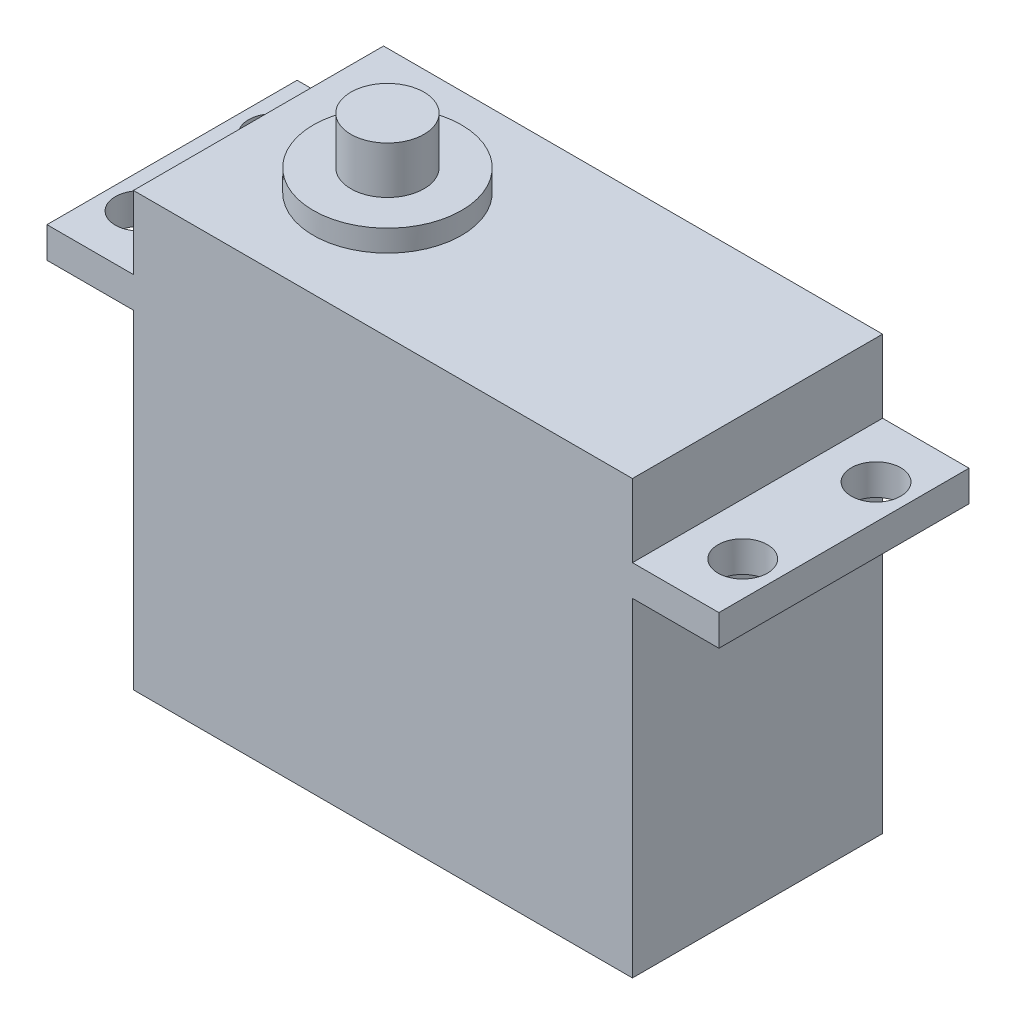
ISO-10303-21;
HEADER;
FILE_DESCRIPTION(('STEP AP214'),'2;1');
FILE_NAME('part.step','',(''),(''),'','','');
FILE_SCHEMA(('AUTOMOTIVE_DESIGN { 1 0 10303 214 1 1 1 1 }'));
ENDSEC;
DATA;
#1=APPLICATION_CONTEXT('core data for automotive mechanical design processes');
#2=APPLICATION_PROTOCOL_DEFINITION('international standard','automotive_design',2000,#1);
#3=PRODUCT_CONTEXT('',#1,'mechanical');
#4=PRODUCT('Part','Part','',(#3));
#5=PRODUCT_RELATED_PRODUCT_CATEGORY('part','',(#4));
#6=PRODUCT_DEFINITION_FORMATION('','',#4);
#7=PRODUCT_DEFINITION_CONTEXT('part definition',#1,'design');
#8=PRODUCT_DEFINITION('design','',#6,#7);
#9=PRODUCT_DEFINITION_SHAPE('','',#8);
#10=(LENGTH_UNIT() NAMED_UNIT(*) SI_UNIT(.MILLI.,.METRE.));
#11=(NAMED_UNIT(*) PLANE_ANGLE_UNIT() SI_UNIT($,.RADIAN.));
#12=(NAMED_UNIT(*) SI_UNIT($,.STERADIAN.) SOLID_ANGLE_UNIT());
#13=UNCERTAINTY_MEASURE_WITH_UNIT(LENGTH_MEASURE(1.E-05),#10,'distance_accuracy_value','');
#14=(GEOMETRIC_REPRESENTATION_CONTEXT(3) GLOBAL_UNCERTAINTY_ASSIGNED_CONTEXT((#13)) GLOBAL_UNIT_ASSIGNED_CONTEXT((#10,
#11,#12)) REPRESENTATION_CONTEXT('',''));
#15=CARTESIAN_POINT('',(0.,0.,0.));
#16=DIRECTION('',(0.,0.,1.));
#17=DIRECTION('',(1.,0.,0.));
#18=AXIS2_PLACEMENT_3D('',#15,#16,#17);
#19=CARTESIAN_POINT('',(0.,35.02,0.));
#20=DIRECTION('',(0.,-1.,0.));
#21=DIRECTION('',(0.,0.,-1.));
#22=AXIS2_PLACEMENT_3D('',#19,#20,#21);
#23=PLANE('',#22);
#24=DIRECTION('',(1.,0.,0.));
#25=VECTOR('',#24,1.);
#26=CARTESIAN_POINT('',(40.4,35.02,0.));
#27=LINE('',#26,#25);
#28=CARTESIAN_POINT('',(0.,35.02,0.));
#29=VERTEX_POINT('',#28);
#30=CARTESIAN_POINT('',(40.4,35.02,0.));
#31=VERTEX_POINT('',#30);
#32=EDGE_CURVE('E189',#29,#31,#27,.T.);
#33=ORIENTED_EDGE('',*,*,#32,.T.);
#34=DIRECTION('',(0.,0.,-1.));
#35=VECTOR('',#34,1.);
#36=CARTESIAN_POINT('',(40.4,35.02,-20.25));
#37=LINE('',#36,#35);
#38=CARTESIAN_POINT('',(40.4,35.02,-20.25));
#39=VERTEX_POINT('',#38);
#40=EDGE_CURVE('E192',#31,#39,#37,.T.);
#41=ORIENTED_EDGE('',*,*,#40,.T.);
#42=DIRECTION('',(-1.,0.,0.));
#43=VECTOR('',#42,1.);
#44=CARTESIAN_POINT('',(0.,35.02,-20.25));
#45=LINE('',#44,#43);
#46=CARTESIAN_POINT('',(0.,35.02,-20.25));
#47=VERTEX_POINT('',#46);
#48=EDGE_CURVE('E195',#39,#47,#45,.T.);
#49=ORIENTED_EDGE('',*,*,#48,.T.);
#50=DIRECTION('',(0.,0.,1.));
#51=VECTOR('',#50,1.);
#52=CARTESIAN_POINT('',(0.,35.02,0.));
#53=LINE('',#52,#51);
#54=EDGE_CURVE('E197',#47,#29,#53,.T.);
#55=ORIENTED_EDGE('',*,*,#54,.T.);
#56=EDGE_LOOP('',(#33,#41,#49,#55));
#57=FACE_BOUND('',#56,.T.);
#58=CARTESIAN_POINT('',(10.44,35.02,-10.125));
#59=DIRECTION('',(0.,-1.,0.));
#60=DIRECTION('',(0.,0.,-1.));
#61=AXIS2_PLACEMENT_3D('',#58,#59,#60);
#62=CIRCLE('',#61,6.);
#63=CARTESIAN_POINT('',(10.44,35.02,-16.125));
#64=VERTEX_POINT('',#63);
#65=EDGE_CURVE('E11',#64,#64,#62,.F.);
#66=ORIENTED_EDGE('',*,*,#65,.F.);
#67=EDGE_LOOP('',(#66));
#68=FACE_BOUND('',#67,.T.);
#69=ADVANCED_FACE('F34',(#57,#68),#23,.F.);
#70=CARTESIAN_POINT('',(0.,26.62,-20.25));
#71=DIRECTION('',(1.,0.,0.));
#72=DIRECTION('',(0.,0.,-1.));
#73=AXIS2_PLACEMENT_3D('',#70,#71,#72);
#74=PLANE('',#73);
#75=DIRECTION('',(0.,0.,1.));
#76=VECTOR('',#75,1.);
#77=CARTESIAN_POINT('',(0.,0.,-20.25));
#78=LINE('',#77,#76);
#79=CARTESIAN_POINT('',(0.,0.,-20.25));
#80=VERTEX_POINT('',#79);
#81=CARTESIAN_POINT('',(0.,0.,0.));
#82=VERTEX_POINT('',#81);
#83=EDGE_CURVE('E337',#80,#82,#78,.T.);
#84=ORIENTED_EDGE('',*,*,#83,.T.);
#85=DIRECTION('',(0.,-1.,0.));
#86=VECTOR('',#85,1.);
#87=CARTESIAN_POINT('',(0.,26.62,0.));
#88=LINE('',#87,#86);
#89=CARTESIAN_POINT('',(0.,26.62,0.));
#90=VERTEX_POINT('',#89);
#91=EDGE_CURVE('E42',#90,#82,#88,.T.);
#92=ORIENTED_EDGE('',*,*,#91,.F.);
#93=DIRECTION('',(0.,0.,1.));
#94=VECTOR('',#93,1.);
#95=CARTESIAN_POINT('',(0.,26.62,-20.25));
#96=LINE('',#95,#94);
#97=CARTESIAN_POINT('',(0.,26.62,-20.25));
#98=VERTEX_POINT('',#97);
#99=EDGE_CURVE('E364',#98,#90,#96,.T.);
#100=ORIENTED_EDGE('',*,*,#99,.F.);
#101=DIRECTION('',(0.,-1.,0.));
#102=VECTOR('',#101,1.);
#103=CARTESIAN_POINT('',(0.,26.62,-20.25));
#104=LINE('',#103,#102);
#105=EDGE_CURVE('E363',#98,#80,#104,.T.);
#106=ORIENTED_EDGE('',*,*,#105,.T.);
#107=EDGE_LOOP('',(#84,#92,#100,#106));
#108=FACE_BOUND('',#107,.T.);
#109=DIRECTION('',(0.,0.,1.));
#110=VECTOR('',#109,1.);
#111=CARTESIAN_POINT('',(0.,3.35,-10.125));
#112=LINE('',#111,#110);
#113=CARTESIAN_POINT('',(0.,3.35,-13.37));
#114=VERTEX_POINT('',#113);
#115=CARTESIAN_POINT('',(0.,3.35,-6.88));
#116=VERTEX_POINT('',#115);
#117=EDGE_CURVE('E160',#114,#116,#112,.T.);
#118=ORIENTED_EDGE('',*,*,#117,.F.);
#119=DIRECTION('',(0.,-1.,0.));
#120=VECTOR('',#119,1.);
#121=CARTESIAN_POINT('',(0.,6.96,-13.37));
#122=LINE('',#121,#120);
#123=CARTESIAN_POINT('',(0.,6.96,-13.37));
#124=VERTEX_POINT('',#123);
#125=EDGE_CURVE('E155',#124,#114,#122,.T.);
#126=ORIENTED_EDGE('',*,*,#125,.F.);
#127=DIRECTION('',(0.,0.,-1.));
#128=VECTOR('',#127,1.);
#129=CARTESIAN_POINT('',(0.,6.96,-6.88));
#130=LINE('',#129,#128);
#131=CARTESIAN_POINT('',(0.,6.96,-6.88));
#132=VERTEX_POINT('',#131);
#133=EDGE_CURVE('E54',#132,#124,#130,.T.);
#134=ORIENTED_EDGE('',*,*,#133,.F.);
#135=DIRECTION('',(0.,1.,0.));
#136=VECTOR('',#135,1.);
#137=CARTESIAN_POINT('',(0.,3.35,-6.88));
#138=LINE('',#137,#136);
#139=EDGE_CURVE('E49',#116,#132,#138,.T.);
#140=ORIENTED_EDGE('',*,*,#139,.F.);
#141=EDGE_LOOP('',(#118,#126,#134,#140));
#142=FACE_BOUND('',#141,.T.);
#143=ADVANCED_FACE('F36',(#108,#142),#74,.F.);
#144=CARTESIAN_POINT('',(47.4,29.12,0.));
#145=DIRECTION('',(0.,1.,0.));
#146=DIRECTION('',(0.,0.,1.));
#147=AXIS2_PLACEMENT_3D('',#144,#145,#146);
#148=PLANE('',#147);
#149=CARTESIAN_POINT('',(-4.2,29.12,-15.52));
#150=DIRECTION('',(0.,1.,0.));
#151=DIRECTION('',(0.,0.,-1.));
#152=AXIS2_PLACEMENT_3D('',#149,#150,#151);
#153=CIRCLE('',#152,2.);
#154=CARTESIAN_POINT('',(-4.2,29.12,-17.52));
#155=VERTEX_POINT('',#154);
#156=EDGE_CURVE('E238',#155,#155,#153,.T.);
#157=ORIENTED_EDGE('',*,*,#156,.F.);
#158=EDGE_LOOP('',(#157));
#159=FACE_BOUND('',#158,.T.);
#160=CARTESIAN_POINT('',(-4.2,29.12,-4.73));
#161=DIRECTION('',(0.,1.,0.));
#162=DIRECTION('',(0.,0.,1.));
#163=AXIS2_PLACEMENT_3D('',#160,#161,#162);
#164=CIRCLE('',#163,2.);
#165=CARTESIAN_POINT('',(-4.2,29.12,-2.73));
#166=VERTEX_POINT('',#165);
#167=EDGE_CURVE('E235',#166,#166,#164,.T.);
#168=ORIENTED_EDGE('',*,*,#167,.F.);
#169=EDGE_LOOP('',(#168));
#170=FACE_BOUND('',#169,.T.);
#171=DIRECTION('',(0.,0.,1.));
#172=VECTOR('',#171,1.);
#173=CARTESIAN_POINT('',(0.,29.12,0.));
#174=LINE('',#173,#172);
#175=CARTESIAN_POINT('',(0.,29.12,-20.25));
#176=VERTEX_POINT('',#175);
#177=CARTESIAN_POINT('',(0.,29.12,0.));
#178=VERTEX_POINT('',#177);
#179=EDGE_CURVE('E193',#176,#178,#174,.T.);
#180=ORIENTED_EDGE('',*,*,#179,.F.);
#181=DIRECTION('',(-1.,0.,0.));
#182=VECTOR('',#181,1.);
#183=CARTESIAN_POINT('',(47.4,29.12,-20.25));
#184=LINE('',#183,#182);
#185=CARTESIAN_POINT('',(-7.,29.12,-20.25));
#186=VERTEX_POINT('',#185);
#187=EDGE_CURVE('E208',#176,#186,#184,.T.);
#188=ORIENTED_EDGE('',*,*,#187,.T.);
#189=DIRECTION('',(0.,0.,1.));
#190=VECTOR('',#189,1.);
#191=CARTESIAN_POINT('',(-7.,29.12,-20.25));
#192=LINE('',#191,#190);
#193=CARTESIAN_POINT('',(-7.,29.12,0.));
#194=VERTEX_POINT('',#193);
#195=EDGE_CURVE('E321',#186,#194,#192,.T.);
#196=ORIENTED_EDGE('',*,*,#195,.T.);
#197=DIRECTION('',(1.,0.,0.));
#198=VECTOR('',#197,1.);
#199=CARTESIAN_POINT('',(-7.,29.12,0.));
#200=LINE('',#199,#198);
#201=EDGE_CURVE('E278',#194,#178,#200,.T.);
#202=ORIENTED_EDGE('',*,*,#201,.T.);
#203=EDGE_LOOP('',(#180,#188,#196,#202));
#204=FACE_BOUND('',#203,.T.);
#205=ADVANCED_FACE('F268',(#159,#170,#204),#148,.T.);
#206=CARTESIAN_POINT('',(0.,26.62,0.));
#207=DIRECTION('',(0.,0.,-1.));
#208=DIRECTION('',(-1.,0.,0.));
#209=AXIS2_PLACEMENT_3D('',#206,#207,#208);
#210=PLANE('',#209);
#211=DIRECTION('',(1.,0.,0.));
#212=VECTOR('',#211,1.);
#213=CARTESIAN_POINT('',(0.,0.,0.));
#214=LINE('',#213,#212);
#215=CARTESIAN_POINT('',(40.4,0.,0.));
#216=VERTEX_POINT('',#215);
#217=EDGE_CURVE('E384',#82,#216,#214,.T.);
#218=ORIENTED_EDGE('',*,*,#217,.T.);
#219=DIRECTION('',(0.,-1.,0.));
#220=VECTOR('',#219,1.);
#221=CARTESIAN_POINT('',(40.4,26.62,0.));
#222=LINE('',#221,#220);
#223=CARTESIAN_POINT('',(40.4,26.62,0.));
#224=VERTEX_POINT('',#223);
#225=EDGE_CURVE('E377',#224,#216,#222,.T.);
#226=ORIENTED_EDGE('',*,*,#225,.F.);
#227=DIRECTION('',(1.,0.,0.));
#228=VECTOR('',#227,1.);
#229=CARTESIAN_POINT('',(20.2,26.62,0.));
#230=LINE('',#229,#228);
#231=CARTESIAN_POINT('',(47.4,26.62,0.));
#232=VERTEX_POINT('',#231);
#233=EDGE_CURVE('E220',#224,#232,#230,.T.);
#234=ORIENTED_EDGE('',*,*,#233,.T.);
#235=DIRECTION('',(0.,-1.,0.));
#236=VECTOR('',#235,1.);
#237=CARTESIAN_POINT('',(47.4,29.12,0.));
#238=LINE('',#237,#236);
#239=CARTESIAN_POINT('',(47.4,29.12,0.));
#240=VERTEX_POINT('',#239);
#241=EDGE_CURVE('E307',#240,#232,#238,.T.);
#242=ORIENTED_EDGE('',*,*,#241,.F.);
#243=CARTESIAN_POINT('',(40.4,29.12,0.));
#244=VERTEX_POINT('',#243);
#245=EDGE_CURVE('E303',#244,#240,#200,.T.);
#246=ORIENTED_EDGE('',*,*,#245,.F.);
#247=DIRECTION('',(0.,-1.,0.));
#248=VECTOR('',#247,1.);
#249=CARTESIAN_POINT('',(40.4,35.02,0.));
#250=LINE('',#249,#248);
#251=EDGE_CURVE('E214',#31,#244,#250,.T.);
#252=ORIENTED_EDGE('',*,*,#251,.F.);
#253=ORIENTED_EDGE('',*,*,#32,.F.);
#254=DIRECTION('',(0.,-1.,0.));
#255=VECTOR('',#254,1.);
#256=CARTESIAN_POINT('',(0.,35.02,0.));
#257=LINE('',#256,#255);
#258=EDGE_CURVE('E199',#29,#178,#257,.T.);
#259=ORIENTED_EDGE('',*,*,#258,.T.);
#260=ORIENTED_EDGE('',*,*,#201,.F.);
#261=DIRECTION('',(0.,-1.,0.));
#262=VECTOR('',#261,1.);
#263=CARTESIAN_POINT('',(-7.,29.12,0.));
#264=LINE('',#263,#262);
#265=CARTESIAN_POINT('',(-7.,26.62,0.));
#266=VERTEX_POINT('',#265);
#267=EDGE_CURVE('E324',#194,#266,#264,.T.);
#268=ORIENTED_EDGE('',*,*,#267,.T.);
#269=EDGE_CURVE('E333',#266,#90,#230,.T.);
#270=ORIENTED_EDGE('',*,*,#269,.T.);
#271=ORIENTED_EDGE('',*,*,#91,.T.);
#272=EDGE_LOOP('',(#218,#226,#234,#242,#246,#252,#253,#259,#260,#268,#270,#271));
#273=FACE_BOUND('',#272,.T.);
#274=ADVANCED_FACE('F271',(#273),#210,.F.);
#275=CARTESIAN_POINT('',(40.4,26.62,0.));
#276=DIRECTION('',(-1.,0.,0.));
#277=DIRECTION('',(0.,0.,1.));
#278=AXIS2_PLACEMENT_3D('',#275,#276,#277);
#279=PLANE('',#278);
#280=DIRECTION('',(0.,0.,-1.));
#281=VECTOR('',#280,1.);
#282=CARTESIAN_POINT('',(40.4,0.,0.));
#283=LINE('',#282,#281);
#284=CARTESIAN_POINT('',(40.4,0.,-20.25));
#285=VERTEX_POINT('',#284);
#286=EDGE_CURVE('E386',#216,#285,#283,.T.);
#287=ORIENTED_EDGE('',*,*,#286,.T.);
#288=DIRECTION('',(0.,-1.,0.));
#289=VECTOR('',#288,1.);
#290=CARTESIAN_POINT('',(40.4,26.62,-20.25));
#291=LINE('',#290,#289);
#292=CARTESIAN_POINT('',(40.4,26.62,-20.25));
#293=VERTEX_POINT('',#292);
#294=EDGE_CURVE('E367',#293,#285,#291,.T.);
#295=ORIENTED_EDGE('',*,*,#294,.F.);
#296=DIRECTION('',(0.,0.,-1.));
#297=VECTOR('',#296,1.);
#298=CARTESIAN_POINT('',(40.4,26.62,0.));
#299=LINE('',#298,#297);
#300=EDGE_CURVE('E360',#224,#293,#299,.T.);
#301=ORIENTED_EDGE('',*,*,#300,.F.);
#302=ORIENTED_EDGE('',*,*,#225,.T.);
#303=EDGE_LOOP('',(#287,#295,#301,#302));
#304=FACE_BOUND('',#303,.T.);
#305=ADVANCED_FACE('F401',(#304),#279,.F.);
#306=CARTESIAN_POINT('',(40.4,26.62,-20.25));
#307=DIRECTION('',(0.,0.,1.));
#308=DIRECTION('',(1.,0.,0.));
#309=AXIS2_PLACEMENT_3D('',#306,#307,#308);
#310=PLANE('',#309);
#311=DIRECTION('',(-1.,0.,0.));
#312=VECTOR('',#311,1.);
#313=CARTESIAN_POINT('',(40.4,0.,-20.25));
#314=LINE('',#313,#312);
#315=EDGE_CURVE('E370',#285,#80,#314,.T.);
#316=ORIENTED_EDGE('',*,*,#315,.T.);
#317=ORIENTED_EDGE('',*,*,#105,.F.);
#318=DIRECTION('',(-1.,0.,0.));
#319=VECTOR('',#318,1.);
#320=CARTESIAN_POINT('',(47.4,26.62,-20.25));
#321=LINE('',#320,#319);
#322=CARTESIAN_POINT('',(-7.,26.62,-20.25));
#323=VERTEX_POINT('',#322);
#324=EDGE_CURVE('E345',#98,#323,#321,.T.);
#325=ORIENTED_EDGE('',*,*,#324,.T.);
#326=DIRECTION('',(0.,-1.,0.));
#327=VECTOR('',#326,1.);
#328=CARTESIAN_POINT('',(-7.,29.12,-20.25));
#329=LINE('',#328,#327);
#330=EDGE_CURVE('E287',#186,#323,#329,.T.);
#331=ORIENTED_EDGE('',*,*,#330,.F.);
#332=ORIENTED_EDGE('',*,*,#187,.F.);
#333=DIRECTION('',(0.,-1.,0.));
#334=VECTOR('',#333,1.);
#335=CARTESIAN_POINT('',(0.,35.02,-20.25));
#336=LINE('',#335,#334);
#337=EDGE_CURVE('E215',#47,#176,#336,.T.);
#338=ORIENTED_EDGE('',*,*,#337,.F.);
#339=ORIENTED_EDGE('',*,*,#48,.F.);
#340=DIRECTION('',(0.,-1.,0.));
#341=VECTOR('',#340,1.);
#342=CARTESIAN_POINT('',(40.4,35.02,-20.25));
#343=LINE('',#342,#341);
#344=CARTESIAN_POINT('',(40.4,29.12,-20.25));
#345=VERTEX_POINT('',#344);
#346=EDGE_CURVE('E211',#39,#345,#343,.T.);
#347=ORIENTED_EDGE('',*,*,#346,.T.);
#348=CARTESIAN_POINT('',(47.4,29.12,-20.25));
#349=VERTEX_POINT('',#348);
#350=EDGE_CURVE('E289',#349,#345,#184,.T.);
#351=ORIENTED_EDGE('',*,*,#350,.F.);
#352=DIRECTION('',(0.,-1.,0.));
#353=VECTOR('',#352,1.);
#354=CARTESIAN_POINT('',(47.4,29.12,-20.25));
#355=LINE('',#354,#353);
#356=CARTESIAN_POINT('',(47.4,26.62,-20.25));
#357=VERTEX_POINT('',#356);
#358=EDGE_CURVE('E338',#349,#357,#355,.T.);
#359=ORIENTED_EDGE('',*,*,#358,.T.);
#360=EDGE_CURVE('E313',#357,#293,#321,.T.);
#361=ORIENTED_EDGE('',*,*,#360,.T.);
#362=ORIENTED_EDGE('',*,*,#294,.T.);
#363=EDGE_LOOP('',(#316,#317,#325,#331,#332,#338,#339,#347,#351,#359,#361,#362));
#364=FACE_BOUND('',#363,.T.);
#365=ADVANCED_FACE('F283',(#364),#310,.F.);
#366=CARTESIAN_POINT('',(0.,0.,0.));
#367=DIRECTION('',(0.,1.,0.));
#368=DIRECTION('',(0.,0.,1.));
#369=AXIS2_PLACEMENT_3D('',#366,#367,#368);
#370=PLANE('',#369);
#371=ORIENTED_EDGE('',*,*,#83,.F.);
#372=ORIENTED_EDGE('',*,*,#315,.F.);
#373=ORIENTED_EDGE('',*,*,#286,.F.);
#374=ORIENTED_EDGE('',*,*,#217,.F.);
#375=EDGE_LOOP('',(#371,#372,#373,#374));
#376=FACE_BOUND('',#375,.T.);
#377=ADVANCED_FACE('F400',(#376),#370,.F.);
#378=CARTESIAN_POINT('',(47.4,26.62,0.));
#379=DIRECTION('',(0.,1.,0.));
#380=DIRECTION('',(0.,0.,1.));
#381=AXIS2_PLACEMENT_3D('',#378,#379,#380);
#382=PLANE('',#381);
#383=CARTESIAN_POINT('',(-4.2,26.62,-15.52));
#384=DIRECTION('',(0.,1.,0.));
#385=DIRECTION('',(0.,0.,1.));
#386=AXIS2_PLACEMENT_3D('',#383,#384,#385);
#387=CIRCLE('',#386,2.);
#388=CARTESIAN_POINT('',(-4.2,26.62,-13.52));
#389=VERTEX_POINT('',#388);
#390=EDGE_CURVE('E236',#389,#389,#387,.T.);
#391=ORIENTED_EDGE('',*,*,#390,.T.);
#392=EDGE_LOOP('',(#391));
#393=FACE_BOUND('',#392,.T.);
#394=CARTESIAN_POINT('',(-4.2,26.62,-4.73));
#395=DIRECTION('',(0.,1.,0.));
#396=DIRECTION('',(0.,0.,1.));
#397=AXIS2_PLACEMENT_3D('',#394,#395,#396);
#398=CIRCLE('',#397,2.);
#399=CARTESIAN_POINT('',(-4.2,26.62,-2.73));
#400=VERTEX_POINT('',#399);
#401=EDGE_CURVE('E176',#400,#400,#398,.T.);
#402=ORIENTED_EDGE('',*,*,#401,.T.);
#403=EDGE_LOOP('',(#402));
#404=FACE_BOUND('',#403,.T.);
#405=ORIENTED_EDGE('',*,*,#324,.F.);
#406=ORIENTED_EDGE('',*,*,#99,.T.);
#407=ORIENTED_EDGE('',*,*,#269,.F.);
#408=DIRECTION('',(0.,0.,1.));
#409=VECTOR('',#408,1.);
#410=CARTESIAN_POINT('',(-7.,26.62,-20.25));
#411=LINE('',#410,#409);
#412=EDGE_CURVE('E309',#323,#266,#411,.T.);
#413=ORIENTED_EDGE('',*,*,#412,.F.);
#414=EDGE_LOOP('',(#405,#406,#407,#413));
#415=FACE_BOUND('',#414,.T.);
#416=ADVANCED_FACE('F425',(#393,#404,#415),#382,.F.);
#417=CARTESIAN_POINT('',(44.6,26.62,-4.73));
#418=DIRECTION('',(0.,1.,0.));
#419=DIRECTION('',(0.,0.,1.));
#420=AXIS2_PLACEMENT_3D('',#417,#418,#419);
#421=CIRCLE('',#420,2.);
#422=CARTESIAN_POINT('',(44.6,26.62,-2.73000000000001));
#423=VERTEX_POINT('',#422);
#424=EDGE_CURVE('E246',#423,#423,#421,.T.);
#425=ORIENTED_EDGE('',*,*,#424,.T.);
#426=EDGE_LOOP('',(#425));
#427=FACE_BOUND('',#426,.T.);
#428=CARTESIAN_POINT('',(44.6,26.62,-15.52));
#429=DIRECTION('',(0.,1.,0.));
#430=DIRECTION('',(0.,0.,1.));
#431=AXIS2_PLACEMENT_3D('',#428,#429,#430);
#432=CIRCLE('',#431,2.);
#433=CARTESIAN_POINT('',(44.6,26.62,-13.52));
#434=VERTEX_POINT('',#433);
#435=EDGE_CURVE('E258',#434,#434,#432,.T.);
#436=ORIENTED_EDGE('',*,*,#435,.T.);
#437=EDGE_LOOP('',(#436));
#438=FACE_BOUND('',#437,.T.);
#439=ORIENTED_EDGE('',*,*,#233,.F.);
#440=ORIENTED_EDGE('',*,*,#300,.T.);
#441=ORIENTED_EDGE('',*,*,#360,.F.);
#442=DIRECTION('',(0.,0.,-1.));
#443=VECTOR('',#442,1.);
#444=CARTESIAN_POINT('',(47.4,26.62,0.));
#445=LINE('',#444,#443);
#446=EDGE_CURVE('E327',#232,#357,#445,.T.);
#447=ORIENTED_EDGE('',*,*,#446,.F.);
#448=EDGE_LOOP('',(#439,#440,#441,#447));
#449=FACE_BOUND('',#448,.T.);
#450=ADVANCED_FACE('F358',(#427,#438,#449),#382,.F.);
#451=CARTESIAN_POINT('',(47.4,29.12,0.));
#452=DIRECTION('',(-1.,0.,0.));
#453=DIRECTION('',(0.,0.,1.));
#454=AXIS2_PLACEMENT_3D('',#451,#452,#453);
#455=PLANE('',#454);
#456=ORIENTED_EDGE('',*,*,#446,.T.);
#457=ORIENTED_EDGE('',*,*,#358,.F.);
#458=DIRECTION('',(0.,0.,-1.));
#459=VECTOR('',#458,1.);
#460=CARTESIAN_POINT('',(47.4,29.12,0.));
#461=LINE('',#460,#459);
#462=EDGE_CURVE('E290',#240,#349,#461,.T.);
#463=ORIENTED_EDGE('',*,*,#462,.F.);
#464=ORIENTED_EDGE('',*,*,#241,.T.);
#465=EDGE_LOOP('',(#456,#457,#463,#464));
#466=FACE_BOUND('',#465,.T.);
#467=ADVANCED_FACE('F354',(#466),#455,.F.);
#468=CARTESIAN_POINT('',(-7.,29.12,-20.25));
#469=DIRECTION('',(1.,0.,0.));
#470=DIRECTION('',(0.,0.,-1.));
#471=AXIS2_PLACEMENT_3D('',#468,#469,#470);
#472=PLANE('',#471);
#473=ORIENTED_EDGE('',*,*,#412,.T.);
#474=ORIENTED_EDGE('',*,*,#267,.F.);
#475=ORIENTED_EDGE('',*,*,#195,.F.);
#476=ORIENTED_EDGE('',*,*,#330,.T.);
#477=EDGE_LOOP('',(#473,#474,#475,#476));
#478=FACE_BOUND('',#477,.T.);
#479=ADVANCED_FACE('F423',(#478),#472,.F.);
#480=CARTESIAN_POINT('',(44.6,29.12,-4.73));
#481=DIRECTION('',(0.,1.,0.));
#482=DIRECTION('',(0.,0.,-1.));
#483=AXIS2_PLACEMENT_3D('',#480,#481,#482);
#484=CIRCLE('',#483,2.);
#485=CARTESIAN_POINT('',(44.6,29.12,-6.73));
#486=VERTEX_POINT('',#485);
#487=EDGE_CURVE('E241',#486,#486,#484,.T.);
#488=ORIENTED_EDGE('',*,*,#487,.F.);
#489=EDGE_LOOP('',(#488));
#490=FACE_BOUND('',#489,.T.);
#491=CARTESIAN_POINT('',(44.6,29.12,-15.52));
#492=DIRECTION('',(0.,1.,0.));
#493=DIRECTION('',(0.,0.,1.));
#494=AXIS2_PLACEMENT_3D('',#491,#492,#493);
#495=CIRCLE('',#494,2.);
#496=CARTESIAN_POINT('',(44.6,29.12,-13.52));
#497=VERTEX_POINT('',#496);
#498=EDGE_CURVE('E255',#497,#497,#495,.T.);
#499=ORIENTED_EDGE('',*,*,#498,.F.);
#500=EDGE_LOOP('',(#499));
#501=FACE_BOUND('',#500,.T.);
#502=DIRECTION('',(0.,0.,-1.));
#503=VECTOR('',#502,1.);
#504=CARTESIAN_POINT('',(40.4,29.12,-20.25));
#505=LINE('',#504,#503);
#506=EDGE_CURVE('E188',#244,#345,#505,.T.);
#507=ORIENTED_EDGE('',*,*,#506,.F.);
#508=ORIENTED_EDGE('',*,*,#245,.T.);
#509=ORIENTED_EDGE('',*,*,#462,.T.);
#510=ORIENTED_EDGE('',*,*,#350,.T.);
#511=EDGE_LOOP('',(#507,#508,#509,#510));
#512=FACE_BOUND('',#511,.T.);
#513=ADVANCED_FACE('F274',(#490,#501,#512),#148,.T.);
#514=CARTESIAN_POINT('',(40.4,35.02,-20.25));
#515=DIRECTION('',(-1.,0.,0.));
#516=DIRECTION('',(0.,0.,1.));
#517=AXIS2_PLACEMENT_3D('',#514,#515,#516);
#518=PLANE('',#517);
#519=ORIENTED_EDGE('',*,*,#506,.T.);
#520=ORIENTED_EDGE('',*,*,#346,.F.);
#521=ORIENTED_EDGE('',*,*,#40,.F.);
#522=ORIENTED_EDGE('',*,*,#251,.T.);
#523=EDGE_LOOP('',(#519,#520,#521,#522));
#524=FACE_BOUND('',#523,.T.);
#525=ADVANCED_FACE('F300',(#524),#518,.F.);
#526=CARTESIAN_POINT('',(0.,35.02,0.));
#527=DIRECTION('',(1.,0.,0.));
#528=DIRECTION('',(0.,0.,-1.));
#529=AXIS2_PLACEMENT_3D('',#526,#527,#528);
#530=PLANE('',#529);
#531=ORIENTED_EDGE('',*,*,#179,.T.);
#532=ORIENTED_EDGE('',*,*,#258,.F.);
#533=ORIENTED_EDGE('',*,*,#54,.F.);
#534=ORIENTED_EDGE('',*,*,#337,.T.);
#535=EDGE_LOOP('',(#531,#532,#533,#534));
#536=FACE_BOUND('',#535,.T.);
#537=ADVANCED_FACE('F291',(#536),#530,.F.);
#538=CARTESIAN_POINT('',(-6.51,3.35,-10.125));
#539=DIRECTION('',(0.,1.,0.));
#540=DIRECTION('',(0.,0.,1.));
#541=AXIS2_PLACEMENT_3D('',#538,#539,#540);
#542=PLANE('',#541);
#543=ORIENTED_EDGE('',*,*,#117,.T.);
#544=DIRECTION('',(1.,0.,0.));
#545=VECTOR('',#544,1.);
#546=CARTESIAN_POINT('',(-6.51,3.35,-6.88));
#547=LINE('',#546,#545);
#548=CARTESIAN_POINT('',(-6.51,3.35,-6.88));
#549=VERTEX_POINT('',#548);
#550=EDGE_CURVE('E158',#549,#116,#547,.T.);
#551=ORIENTED_EDGE('',*,*,#550,.F.);
#552=DIRECTION('',(0.,0.,1.));
#553=VECTOR('',#552,1.);
#554=CARTESIAN_POINT('',(-6.51,3.35,-13.37));
#555=LINE('',#554,#553);
#556=CARTESIAN_POINT('',(-6.51,3.35,-13.37));
#557=VERTEX_POINT('',#556);
#558=EDGE_CURVE('E144',#557,#549,#555,.T.);
#559=ORIENTED_EDGE('',*,*,#558,.F.);
#560=DIRECTION('',(1.,0.,0.));
#561=VECTOR('',#560,1.);
#562=CARTESIAN_POINT('',(-6.51,3.35,-13.37));
#563=LINE('',#562,#561);
#564=EDGE_CURVE('E174',#557,#114,#563,.T.);
#565=ORIENTED_EDGE('',*,*,#564,.T.);
#566=EDGE_LOOP('',(#543,#551,#559,#565));
#567=FACE_BOUND('',#566,.T.);
#568=ADVANCED_FACE('F159',(#567),#542,.F.);
#569=CARTESIAN_POINT('',(-6.51,3.35,-6.88));
#570=DIRECTION('',(0.,0.,-1.));
#571=DIRECTION('',(-1.,0.,0.));
#572=AXIS2_PLACEMENT_3D('',#569,#570,#571);
#573=PLANE('',#572);
#574=ORIENTED_EDGE('',*,*,#139,.T.);
#575=DIRECTION('',(1.,0.,0.));
#576=VECTOR('',#575,1.);
#577=CARTESIAN_POINT('',(-6.51,6.96,-6.88));
#578=LINE('',#577,#576);
#579=CARTESIAN_POINT('',(-6.51,6.96,-6.88));
#580=VERTEX_POINT('',#579);
#581=EDGE_CURVE('E163',#580,#132,#578,.T.);
#582=ORIENTED_EDGE('',*,*,#581,.F.);
#583=DIRECTION('',(0.,1.,0.));
#584=VECTOR('',#583,1.);
#585=CARTESIAN_POINT('',(-6.51,3.35,-6.88));
#586=LINE('',#585,#584);
#587=EDGE_CURVE('E148',#549,#580,#586,.T.);
#588=ORIENTED_EDGE('',*,*,#587,.F.);
#589=ORIENTED_EDGE('',*,*,#550,.T.);
#590=EDGE_LOOP('',(#574,#582,#588,#589));
#591=FACE_BOUND('',#590,.T.);
#592=ADVANCED_FACE('F165',(#591),#573,.F.);
#593=CARTESIAN_POINT('',(-6.51,6.96,-6.88));
#594=DIRECTION('',(0.,-1.,0.));
#595=DIRECTION('',(0.,0.,-1.));
#596=AXIS2_PLACEMENT_3D('',#593,#594,#595);
#597=PLANE('',#596);
#598=ORIENTED_EDGE('',*,*,#133,.T.);
#599=DIRECTION('',(1.,0.,0.));
#600=VECTOR('',#599,1.);
#601=CARTESIAN_POINT('',(-6.51,6.96,-13.37));
#602=LINE('',#601,#600);
#603=CARTESIAN_POINT('',(-6.51,6.96,-13.37));
#604=VERTEX_POINT('',#603);
#605=EDGE_CURVE('E182',#604,#124,#602,.T.);
#606=ORIENTED_EDGE('',*,*,#605,.F.);
#607=DIRECTION('',(0.,0.,-1.));
#608=VECTOR('',#607,1.);
#609=CARTESIAN_POINT('',(-6.51,6.96,-6.88));
#610=LINE('',#609,#608);
#611=EDGE_CURVE('E168',#580,#604,#610,.T.);
#612=ORIENTED_EDGE('',*,*,#611,.F.);
#613=ORIENTED_EDGE('',*,*,#581,.T.);
#614=EDGE_LOOP('',(#598,#606,#612,#613));
#615=FACE_BOUND('',#614,.T.);
#616=ADVANCED_FACE('F486',(#615),#597,.F.);
#617=CARTESIAN_POINT('',(-6.51,6.96,-13.37));
#618=DIRECTION('',(0.,0.,1.));
#619=DIRECTION('',(1.,0.,0.));
#620=AXIS2_PLACEMENT_3D('',#617,#618,#619);
#621=PLANE('',#620);
#622=ORIENTED_EDGE('',*,*,#125,.T.);
#623=ORIENTED_EDGE('',*,*,#564,.F.);
#624=DIRECTION('',(0.,-1.,0.));
#625=VECTOR('',#624,1.);
#626=CARTESIAN_POINT('',(-6.51,6.96,-13.37));
#627=LINE('',#626,#625);
#628=EDGE_CURVE('E151',#604,#557,#627,.T.);
#629=ORIENTED_EDGE('',*,*,#628,.F.);
#630=ORIENTED_EDGE('',*,*,#605,.T.);
#631=EDGE_LOOP('',(#622,#623,#629,#630));
#632=FACE_BOUND('',#631,.T.);
#633=ADVANCED_FACE('F493',(#632),#621,.F.);
#634=CARTESIAN_POINT('',(-6.51,3.35,-6.88));
#635=DIRECTION('',(-1.,0.,0.));
#636=DIRECTION('',(0.,0.,1.));
#637=AXIS2_PLACEMENT_3D('',#634,#635,#636);
#638=PLANE('',#637);
#639=ORIENTED_EDGE('',*,*,#558,.T.);
#640=ORIENTED_EDGE('',*,*,#587,.T.);
#641=ORIENTED_EDGE('',*,*,#611,.T.);
#642=ORIENTED_EDGE('',*,*,#628,.T.);
#643=EDGE_LOOP('',(#639,#640,#641,#642));
#644=FACE_BOUND('',#643,.T.);
#645=ADVANCED_FACE('F146',(#644),#638,.T.);
#646=CARTESIAN_POINT('',(-4.2,22.61,-4.73));
#647=DIRECTION('',(0.,1.,0.));
#648=DIRECTION('',(0.,0.,1.));
#649=AXIS2_PLACEMENT_3D('',#646,#647,#648);
#650=CYLINDRICAL_SURFACE('',#649,2.);
#651=ORIENTED_EDGE('',*,*,#167,.T.);
#652=EDGE_LOOP('',(#651));
#653=FACE_BOUND('',#652,.T.);
#654=ORIENTED_EDGE('',*,*,#401,.F.);
#655=EDGE_LOOP('',(#654));
#656=FACE_BOUND('',#655,.T.);
#657=ADVANCED_FACE('F265',(#653,#656),#650,.F.);
#658=CARTESIAN_POINT('',(-4.2,22.61,-15.52));
#659=DIRECTION('',(0.,1.,0.));
#660=DIRECTION('',(0.,0.,1.));
#661=AXIS2_PLACEMENT_3D('',#658,#659,#660);
#662=CYLINDRICAL_SURFACE('',#661,2.);
#663=ORIENTED_EDGE('',*,*,#156,.T.);
#664=EDGE_LOOP('',(#663));
#665=FACE_BOUND('',#664,.T.);
#666=ORIENTED_EDGE('',*,*,#390,.F.);
#667=EDGE_LOOP('',(#666));
#668=FACE_BOUND('',#667,.T.);
#669=ADVANCED_FACE('F513',(#665,#668),#662,.F.);
#670=CARTESIAN_POINT('',(44.6,22.61,-15.52));
#671=DIRECTION('',(0.,1.,0.));
#672=DIRECTION('',(0.,0.,1.));
#673=AXIS2_PLACEMENT_3D('',#670,#671,#672);
#674=CYLINDRICAL_SURFACE('',#673,2.);
#675=ORIENTED_EDGE('',*,*,#498,.T.);
#676=EDGE_LOOP('',(#675));
#677=FACE_BOUND('',#676,.T.);
#678=ORIENTED_EDGE('',*,*,#435,.F.);
#679=EDGE_LOOP('',(#678));
#680=FACE_BOUND('',#679,.T.);
#681=ADVANCED_FACE('F520',(#677,#680),#674,.F.);
#682=CARTESIAN_POINT('',(44.6,22.61,-4.73));
#683=DIRECTION('',(0.,1.,0.));
#684=DIRECTION('',(0.,0.,1.));
#685=AXIS2_PLACEMENT_3D('',#682,#683,#684);
#686=CYLINDRICAL_SURFACE('',#685,2.);
#687=ORIENTED_EDGE('',*,*,#487,.T.);
#688=EDGE_LOOP('',(#687));
#689=FACE_BOUND('',#688,.T.);
#690=ORIENTED_EDGE('',*,*,#424,.F.);
#691=EDGE_LOOP('',(#690));
#692=FACE_BOUND('',#691,.T.);
#693=ADVANCED_FACE('F528',(#689,#692),#686,.F.);
#694=CARTESIAN_POINT('',(10.44,36.77,-10.125));
#695=DIRECTION('',(0.,1.,0.));
#696=DIRECTION('',(0.,0.,1.));
#697=AXIS2_PLACEMENT_3D('',#694,#695,#696);
#698=PLANE('',#697);
#699=CARTESIAN_POINT('',(10.44,36.77,-10.125));
#700=DIRECTION('',(0.,1.,0.));
#701=DIRECTION('',(0.,0.,1.));
#702=AXIS2_PLACEMENT_3D('',#699,#700,#701);
#703=CIRCLE('',#702,6.);
#704=CARTESIAN_POINT('',(10.44,36.77,-4.125));
#705=VERTEX_POINT('',#704);
#706=EDGE_CURVE('E242',#705,#705,#703,.T.);
#707=ORIENTED_EDGE('',*,*,#706,.T.);
#708=EDGE_LOOP('',(#707));
#709=FACE_BOUND('',#708,.T.);
#710=CARTESIAN_POINT('',(10.44,36.77,-10.125));
#711=DIRECTION('',(0.,1.,0.));
#712=DIRECTION('',(0.,0.,1.));
#713=AXIS2_PLACEMENT_3D('',#710,#711,#712);
#714=CIRCLE('',#713,2.96);
#715=CARTESIAN_POINT('',(10.44,36.77,-7.165));
#716=VERTEX_POINT('',#715);
#717=EDGE_CURVE('E239',#716,#716,#714,.T.);
#718=ORIENTED_EDGE('',*,*,#717,.F.);
#719=EDGE_LOOP('',(#718));
#720=FACE_BOUND('',#719,.T.);
#721=ADVANCED_FACE('F536',(#709,#720),#698,.T.);
#722=CARTESIAN_POINT('',(10.44,36.77,-10.125));
#723=DIRECTION('',(0.,-1.,0.));
#724=DIRECTION('',(0.,0.,-1.));
#725=AXIS2_PLACEMENT_3D('',#722,#723,#724);
#726=CYLINDRICAL_SURFACE('',#725,6.);
#727=ORIENTED_EDGE('',*,*,#706,.F.);
#728=EDGE_LOOP('',(#727));
#729=FACE_BOUND('',#728,.T.);
#730=ORIENTED_EDGE('',*,*,#65,.T.);
#731=EDGE_LOOP('',(#730));
#732=FACE_BOUND('',#731,.T.);
#733=ADVANCED_FACE('F545',(#729,#732),#726,.T.);
#734=CARTESIAN_POINT('',(10.44,40.59,-10.125));
#735=DIRECTION('',(0.,1.,0.));
#736=DIRECTION('',(0.,0.,1.));
#737=AXIS2_PLACEMENT_3D('',#734,#735,#736);
#738=PLANE('',#737);
#739=CARTESIAN_POINT('',(10.44,40.59,-10.125));
#740=DIRECTION('',(0.,1.,0.));
#741=DIRECTION('',(0.,0.,1.));
#742=AXIS2_PLACEMENT_3D('',#739,#740,#741);
#743=CIRCLE('',#742,2.96);
#744=CARTESIAN_POINT('',(10.44,40.59,-7.165));
#745=VERTEX_POINT('',#744);
#746=EDGE_CURVE('E162',#745,#745,#743,.T.);
#747=ORIENTED_EDGE('',*,*,#746,.T.);
#748=EDGE_LOOP('',(#747));
#749=FACE_BOUND('',#748,.T.);
#750=ADVANCED_FACE('F552',(#749),#738,.T.);
#751=CARTESIAN_POINT('',(10.44,40.59,-10.125));
#752=DIRECTION('',(0.,-1.,0.));
#753=DIRECTION('',(0.,0.,-1.));
#754=AXIS2_PLACEMENT_3D('',#751,#752,#753);
#755=CYLINDRICAL_SURFACE('',#754,2.96);
#756=ORIENTED_EDGE('',*,*,#717,.T.);
#757=EDGE_LOOP('',(#756));
#758=FACE_BOUND('',#757,.T.);
#759=ORIENTED_EDGE('',*,*,#746,.F.);
#760=EDGE_LOOP('',(#759));
#761=FACE_BOUND('',#760,.T.);
#762=ADVANCED_FACE('F416',(#758,#761),#755,.T.);
#763=CLOSED_SHELL('',(#69,#143,#205,#274,#305,#365,#377,#416,#450,#467,#479,#513,#525,#537,#568,
#592,#616,#633,#645,#657,#669,#681,#693,#721,#733,#750,#762));
#764=MANIFOLD_SOLID_BREP('B2',#763);
#765=ADVANCED_BREP_SHAPE_REPRESENTATION('',(#18,#764),#14);
#766=SHAPE_DEFINITION_REPRESENTATION(#9,#765);
ENDSEC;
END-ISO-10303-21;
